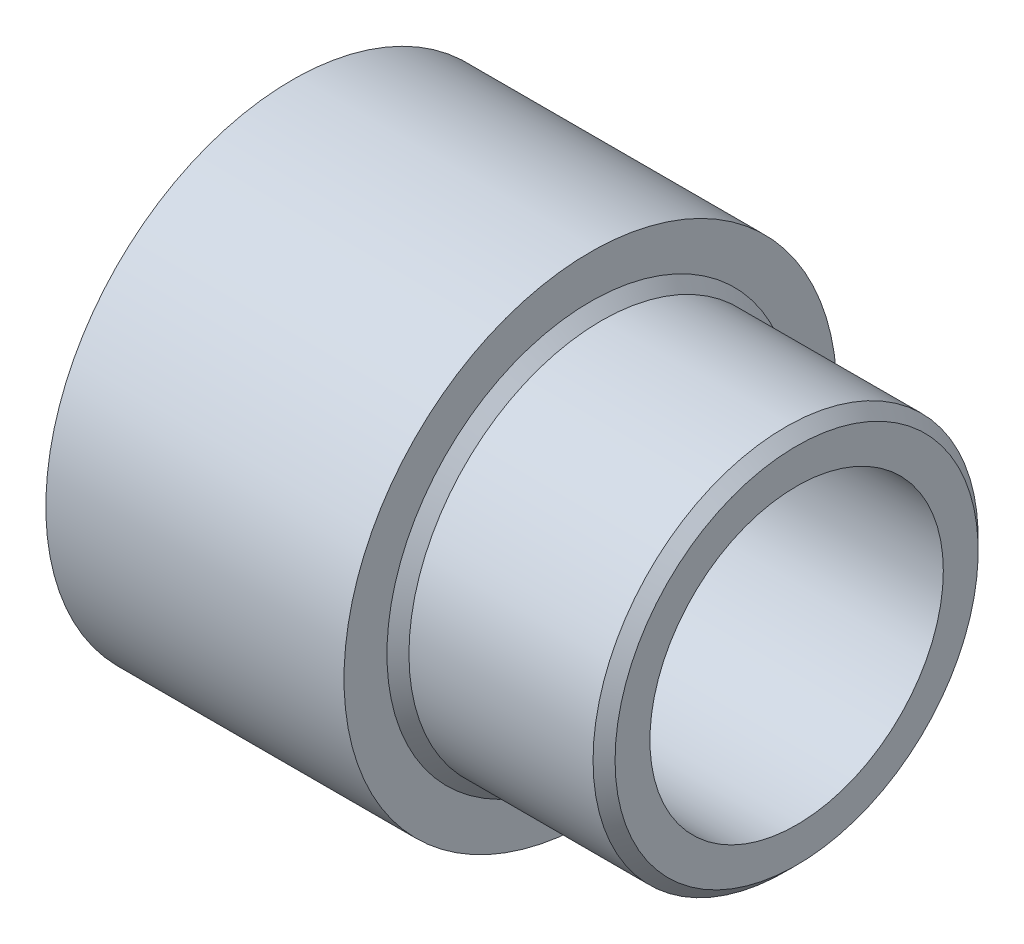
ISO-10303-21;
HEADER;
FILE_DESCRIPTION(('STEP AP214'),'2;1');
FILE_NAME('part.step','',(''),(''),'','','');
FILE_SCHEMA(('AUTOMOTIVE_DESIGN { 1 0 10303 214 1 1 1 1 }'));
ENDSEC;
DATA;
#1=APPLICATION_CONTEXT('core data for automotive mechanical design processes');
#2=APPLICATION_PROTOCOL_DEFINITION('international standard','automotive_design',2000,#1);
#3=PRODUCT_CONTEXT('',#1,'mechanical');
#4=PRODUCT('Part','Part','',(#3));
#5=PRODUCT_RELATED_PRODUCT_CATEGORY('part','',(#4));
#6=PRODUCT_DEFINITION_FORMATION('','',#4);
#7=PRODUCT_DEFINITION_CONTEXT('part definition',#1,'design');
#8=PRODUCT_DEFINITION('design','',#6,#7);
#9=PRODUCT_DEFINITION_SHAPE('','',#8);
#10=(LENGTH_UNIT() NAMED_UNIT(*) SI_UNIT(.MILLI.,.METRE.));
#11=(NAMED_UNIT(*) PLANE_ANGLE_UNIT() SI_UNIT($,.RADIAN.));
#12=(NAMED_UNIT(*) SI_UNIT($,.STERADIAN.) SOLID_ANGLE_UNIT());
#13=UNCERTAINTY_MEASURE_WITH_UNIT(LENGTH_MEASURE(1.E-05),#10,'distance_accuracy_value','');
#14=(GEOMETRIC_REPRESENTATION_CONTEXT(3) GLOBAL_UNCERTAINTY_ASSIGNED_CONTEXT((#13)) GLOBAL_UNIT_ASSIGNED_CONTEXT((#10,
#11,#12)) REPRESENTATION_CONTEXT('',''));
#15=CARTESIAN_POINT('',(0.,0.,0.));
#16=DIRECTION('',(0.,0.,1.));
#17=DIRECTION('',(1.,0.,0.));
#18=AXIS2_PLACEMENT_3D('',#15,#16,#17);
#19=CARTESIAN_POINT('',(34.925,0.,0.));
#20=DIRECTION('',(-1.,0.,0.));
#21=DIRECTION('',(0.,0.,1.));
#22=AXIS2_PLACEMENT_3D('',#19,#20,#21);
#23=PLANE('',#22);
#24=CARTESIAN_POINT('',(34.925,0.,0.));
#25=DIRECTION('',(-1.,0.,0.));
#26=DIRECTION('',(0.,0.,1.));
#27=AXIS2_PLACEMENT_3D('',#24,#25,#26);
#28=CIRCLE('',#27,12.573);
#29=CARTESIAN_POINT('',(34.925,0.,12.573));
#30=VERTEX_POINT('',#29);
#31=EDGE_CURVE('E10',#30,#30,#28,.F.);
#32=ORIENTED_EDGE('',*,*,#31,.T.);
#33=EDGE_LOOP('',(#32));
#34=FACE_BOUND('',#33,.T.);
#35=CARTESIAN_POINT('',(34.925,0.,0.));
#36=DIRECTION('',(1.,0.,0.));
#37=DIRECTION('',(0.,0.,-1.));
#38=AXIS2_PLACEMENT_3D('',#35,#36,#37);
#39=CIRCLE('',#38,10.16);
#40=CARTESIAN_POINT('',(34.925,0.,-10.16));
#41=VERTEX_POINT('',#40);
#42=EDGE_CURVE('E66',#41,#41,#39,.T.);
#43=ORIENTED_EDGE('',*,*,#42,.F.);
#44=EDGE_LOOP('',(#43));
#45=FACE_BOUND('',#44,.T.);
#46=ADVANCED_FACE('F34',(#34,#45),#23,.F.);
#47=CARTESIAN_POINT('',(19.05,0.,0.));
#48=DIRECTION('',(-1.,0.,0.));
#49=DIRECTION('',(0.,0.,1.));
#50=AXIS2_PLACEMENT_3D('',#47,#48,#49);
#51=PLANE('',#50);
#52=CARTESIAN_POINT('',(19.05,0.,0.));
#53=DIRECTION('',(-1.,0.,0.));
#54=DIRECTION('',(0.,0.,1.));
#55=AXIS2_PLACEMENT_3D('',#52,#53,#54);
#56=CIRCLE('',#55,13.5128);
#57=CARTESIAN_POINT('',(19.05,0.,13.5128));
#58=VERTEX_POINT('',#57);
#59=EDGE_CURVE('E60',#58,#58,#56,.T.);
#60=ORIENTED_EDGE('',*,*,#59,.T.);
#61=EDGE_LOOP('',(#60));
#62=FACE_BOUND('',#61,.T.);
#63=CARTESIAN_POINT('',(19.05,0.,0.));
#64=DIRECTION('',(1.,0.,0.));
#65=DIRECTION('',(0.,0.,-1.));
#66=AXIS2_PLACEMENT_3D('',#63,#64,#65);
#67=CIRCLE('',#66,10.16);
#68=CARTESIAN_POINT('',(19.05,0.,-10.16));
#69=VERTEX_POINT('',#68);
#70=EDGE_CURVE('E69',#69,#69,#67,.T.);
#71=ORIENTED_EDGE('',*,*,#70,.T.);
#72=EDGE_LOOP('',(#71));
#73=FACE_BOUND('',#72,.T.);
#74=ADVANCED_FACE('F73',(#62,#73),#51,.T.);
#75=CARTESIAN_POINT('',(20.6502,0.,0.));
#76=DIRECTION('',(-1.,0.,0.));
#77=DIRECTION('',(0.,0.,1.));
#78=AXIS2_PLACEMENT_3D('',#75,#76,#77);
#79=CYLINDRICAL_SURFACE('',#78,17.0688);
#80=CARTESIAN_POINT('',(20.6502,0.,0.));
#81=DIRECTION('',(1.,0.,0.));
#82=DIRECTION('',(0.,0.,-1.));
#83=AXIS2_PLACEMENT_3D('',#80,#81,#82);
#84=CIRCLE('',#83,17.0688);
#85=CARTESIAN_POINT('',(20.6502,0.,-17.0688));
#86=VERTEX_POINT('',#85);
#87=EDGE_CURVE('E54',#86,#86,#84,.T.);
#88=ORIENTED_EDGE('',*,*,#87,.F.);
#89=EDGE_LOOP('',(#88));
#90=FACE_BOUND('',#89,.T.);
#91=CARTESIAN_POINT('',(0.,0.,0.));
#92=DIRECTION('',(1.,0.,0.));
#93=DIRECTION('',(0.,0.,-1.));
#94=AXIS2_PLACEMENT_3D('',#91,#92,#93);
#95=CIRCLE('',#94,17.0688);
#96=CARTESIAN_POINT('',(0.,0.,-17.0688));
#97=VERTEX_POINT('',#96);
#98=EDGE_CURVE('E57',#97,#97,#95,.T.);
#99=ORIENTED_EDGE('',*,*,#98,.T.);
#100=EDGE_LOOP('',(#99));
#101=FACE_BOUND('',#100,.T.);
#102=ADVANCED_FACE('F36',(#90,#101),#79,.T.);
#103=CARTESIAN_POINT('',(20.6502,0.,0.));
#104=DIRECTION('',(1.,0.,0.));
#105=DIRECTION('',(0.,0.,-1.));
#106=AXIS2_PLACEMENT_3D('',#103,#104,#105);
#107=PLANE('',#106);
#108=CARTESIAN_POINT('',(20.6502,0.,0.));
#109=DIRECTION('',(1.,0.,0.));
#110=DIRECTION('',(0.,0.,-1.));
#111=AXIS2_PLACEMENT_3D('',#108,#109,#110);
#112=CIRCLE('',#111,14.097);
#113=CARTESIAN_POINT('',(20.6502,0.,-14.097));
#114=VERTEX_POINT('',#113);
#115=EDGE_CURVE('E41',#114,#114,#112,.F.);
#116=ORIENTED_EDGE('',*,*,#115,.T.);
#117=EDGE_LOOP('',(#116));
#118=FACE_BOUND('',#117,.T.);
#119=ORIENTED_EDGE('',*,*,#87,.T.);
#120=EDGE_LOOP('',(#119));
#121=FACE_BOUND('',#120,.T.);
#122=ADVANCED_FACE('F104',(#118,#121),#107,.T.);
#123=CARTESIAN_POINT('',(0.,0.,0.));
#124=DIRECTION('',(1.,0.,0.));
#125=DIRECTION('',(0.,0.,-1.));
#126=AXIS2_PLACEMENT_3D('',#123,#124,#125);
#127=PLANE('',#126);
#128=CARTESIAN_POINT('',(0.,0.,0.));
#129=DIRECTION('',(-1.,0.,0.));
#130=DIRECTION('',(0.,0.,1.));
#131=AXIS2_PLACEMENT_3D('',#128,#129,#130);
#132=CIRCLE('',#131,13.5128);
#133=CARTESIAN_POINT('',(0.,0.,13.5128));
#134=VERTEX_POINT('',#133);
#135=EDGE_CURVE('E63',#134,#134,#132,.T.);
#136=ORIENTED_EDGE('',*,*,#135,.F.);
#137=EDGE_LOOP('',(#136));
#138=FACE_BOUND('',#137,.T.);
#139=ORIENTED_EDGE('',*,*,#98,.F.);
#140=EDGE_LOOP('',(#139));
#141=FACE_BOUND('',#140,.T.);
#142=ADVANCED_FACE('F101',(#138,#141),#127,.F.);
#143=CARTESIAN_POINT('',(34.925,0.,0.));
#144=DIRECTION('',(-1.,0.,0.));
#145=DIRECTION('',(0.,0.,1.));
#146=AXIS2_PLACEMENT_3D('',#143,#144,#145);
#147=CYLINDRICAL_SURFACE('',#146,13.335);
#148=CARTESIAN_POINT('',(21.4122,0.,0.));
#149=DIRECTION('',(1.,0.,0.));
#150=DIRECTION('',(0.,0.,-1.));
#151=AXIS2_PLACEMENT_3D('',#148,#149,#150);
#152=CIRCLE('',#151,13.335);
#153=CARTESIAN_POINT('',(21.4122,0.,-13.335));
#154=VERTEX_POINT('',#153);
#155=EDGE_CURVE('E45',#154,#154,#152,.T.);
#156=ORIENTED_EDGE('',*,*,#155,.T.);
#157=EDGE_LOOP('',(#156));
#158=FACE_BOUND('',#157,.T.);
#159=CARTESIAN_POINT('',(34.163,0.,0.));
#160=DIRECTION('',(-1.,0.,0.));
#161=DIRECTION('',(0.,0.,1.));
#162=AXIS2_PLACEMENT_3D('',#159,#160,#161);
#163=CIRCLE('',#162,13.335);
#164=CARTESIAN_POINT('',(34.163,0.,13.335));
#165=VERTEX_POINT('',#164);
#166=EDGE_CURVE('E49',#165,#165,#163,.T.);
#167=ORIENTED_EDGE('',*,*,#166,.T.);
#168=EDGE_LOOP('',(#167));
#169=FACE_BOUND('',#168,.T.);
#170=ADVANCED_FACE('F98',(#158,#169),#147,.T.);
#171=CARTESIAN_POINT('',(21.4122,0.,0.));
#172=DIRECTION('',(-1.,0.,0.));
#173=DIRECTION('',(0.,0.,1.));
#174=AXIS2_PLACEMENT_3D('',#171,#172,#173);
#175=CONICAL_SURFACE('',#174,13.335,0.785398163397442);
#176=ORIENTED_EDGE('',*,*,#115,.F.);
#177=EDGE_LOOP('',(#176));
#178=FACE_BOUND('',#177,.T.);
#179=ORIENTED_EDGE('',*,*,#155,.F.);
#180=EDGE_LOOP('',(#179));
#181=FACE_BOUND('',#180,.T.);
#182=ADVANCED_FACE('F96',(#178,#181),#175,.T.);
#183=CARTESIAN_POINT('',(34.163,0.,0.));
#184=DIRECTION('',(-1.,0.,0.));
#185=DIRECTION('',(0.,0.,1.));
#186=AXIS2_PLACEMENT_3D('',#183,#184,#185);
#187=CONICAL_SURFACE('',#186,13.335,0.785398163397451);
#188=ORIENTED_EDGE('',*,*,#31,.F.);
#189=EDGE_LOOP('',(#188));
#190=FACE_BOUND('',#189,.T.);
#191=ORIENTED_EDGE('',*,*,#166,.F.);
#192=EDGE_LOOP('',(#191));
#193=FACE_BOUND('',#192,.T.);
#194=ADVANCED_FACE('F83',(#190,#193),#187,.T.);
#195=CARTESIAN_POINT('',(19.05,0.,0.));
#196=DIRECTION('',(-1.,0.,0.));
#197=DIRECTION('',(0.,0.,1.));
#198=AXIS2_PLACEMENT_3D('',#195,#196,#197);
#199=CYLINDRICAL_SURFACE('',#198,13.5128);
#200=CARTESIAN_POINT('',(19.05,0.,13.5128));
#201=CARTESIAN_POINT('',(18.8515625,0.,13.5128));
#202=CARTESIAN_POINT('',(18.653125,0.,13.5128));
#203=CARTESIAN_POINT('',(18.25625,0.,13.5128));
#204=CARTESIAN_POINT('',(18.0578125,0.,13.5128));
#205=CARTESIAN_POINT('',(17.6609375,0.,13.5128));
#206=CARTESIAN_POINT('',(17.4625,0.,13.5128));
#207=CARTESIAN_POINT('',(17.065625,0.,13.5128));
#208=CARTESIAN_POINT('',(16.8671875,0.,13.5128));
#209=CARTESIAN_POINT('',(16.4703125,0.,13.5128));
#210=CARTESIAN_POINT('',(16.271875,0.,13.5128));
#211=CARTESIAN_POINT('',(15.875,0.,13.5128));
#212=CARTESIAN_POINT('',(15.6765625,0.,13.5128));
#213=CARTESIAN_POINT('',(15.2796875,0.,13.5128));
#214=CARTESIAN_POINT('',(15.08125,0.,13.5128));
#215=CARTESIAN_POINT('',(14.684375,0.,13.5128));
#216=CARTESIAN_POINT('',(14.4859375,0.,13.5128));
#217=CARTESIAN_POINT('',(14.0890625,0.,13.5128));
#218=CARTESIAN_POINT('',(13.890625,0.,13.5128));
#219=CARTESIAN_POINT('',(13.49375,0.,13.5128));
#220=CARTESIAN_POINT('',(13.2953125,0.,13.5128));
#221=CARTESIAN_POINT('',(12.8984375,0.,13.5128));
#222=CARTESIAN_POINT('',(12.7,0.,13.5128));
#223=CARTESIAN_POINT('',(12.303125,0.,13.5128));
#224=CARTESIAN_POINT('',(12.1046875,0.,13.5128));
#225=CARTESIAN_POINT('',(11.7078125,0.,13.5128));
#226=CARTESIAN_POINT('',(11.509375,0.,13.5128));
#227=CARTESIAN_POINT('',(11.1125,0.,13.5128));
#228=CARTESIAN_POINT('',(10.9140625,0.,13.5128));
#229=CARTESIAN_POINT('',(10.5171875,0.,13.5128));
#230=CARTESIAN_POINT('',(10.31875,0.,13.5128));
#231=CARTESIAN_POINT('',(9.921875,0.,13.5128));
#232=CARTESIAN_POINT('',(9.7234375,0.,13.5128));
#233=CARTESIAN_POINT('',(9.3265625,0.,13.5128));
#234=CARTESIAN_POINT('',(9.128125,0.,13.5128));
#235=CARTESIAN_POINT('',(8.73125,0.,13.5128));
#236=CARTESIAN_POINT('',(8.5328125,0.,13.5128));
#237=CARTESIAN_POINT('',(8.1359375,0.,13.5128));
#238=CARTESIAN_POINT('',(7.9375,0.,13.5128));
#239=CARTESIAN_POINT('',(7.540625,0.,13.5128));
#240=CARTESIAN_POINT('',(7.3421875,0.,13.5128));
#241=CARTESIAN_POINT('',(6.9453125,0.,13.5128));
#242=CARTESIAN_POINT('',(6.746875,0.,13.5128));
#243=CARTESIAN_POINT('',(6.35,0.,13.5128));
#244=CARTESIAN_POINT('',(6.1515625,0.,13.5128));
#245=CARTESIAN_POINT('',(5.7546875,0.,13.5128));
#246=CARTESIAN_POINT('',(5.55625,0.,13.5128));
#247=CARTESIAN_POINT('',(5.159375,0.,13.5128));
#248=CARTESIAN_POINT('',(4.9609375,0.,13.5128));
#249=CARTESIAN_POINT('',(4.5640625,0.,13.5128));
#250=CARTESIAN_POINT('',(4.365625,0.,13.5128));
#251=CARTESIAN_POINT('',(3.96875,0.,13.5128));
#252=CARTESIAN_POINT('',(3.7703125,0.,13.5128));
#253=CARTESIAN_POINT('',(3.3734375,0.,13.5128));
#254=CARTESIAN_POINT('',(3.175,0.,13.5128));
#255=CARTESIAN_POINT('',(2.778125,0.,13.5128));
#256=CARTESIAN_POINT('',(2.5796875,0.,13.5128));
#257=CARTESIAN_POINT('',(2.1828125,0.,13.5128));
#258=CARTESIAN_POINT('',(1.984375,0.,13.5128));
#259=CARTESIAN_POINT('',(1.5875,0.,13.5128));
#260=CARTESIAN_POINT('',(1.3890625,0.,13.5128));
#261=CARTESIAN_POINT('',(0.992187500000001,0.,13.5128));
#262=CARTESIAN_POINT('',(0.793750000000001,0.,13.5128));
#263=CARTESIAN_POINT('',(0.396875,0.,13.5128));
#264=CARTESIAN_POINT('',(0.1984375,0.,13.5128));
#265=CARTESIAN_POINT('',(0.,0.,13.5128));
#266=B_SPLINE_CURVE_WITH_KNOTS('',3,(#200,#201,#202,#203,#204,#205,#206,#207,#208,#209,#210,
#211,#212,#213,#214,#215,#216,#217,#218,#219,#220,#221,#222,#223,#224,#225,#226,#227,#228,#229,
#230,#231,#232,#233,#234,#235,#236,#237,#238,#239,#240,#241,#242,#243,#244,#245,#246,#247,#248,
#249,#250,#251,#252,#253,#254,#255,#256,#257,#258,#259,#260,#261,#262,#263,#264,#265),
.UNSPECIFIED.,.F.,.F.,(4,2,2,2,2,2,2,2,2,2,2,2,2,2,2,2,2,2,2,2,2,2,2,2,2,2,2,2,2,2,2,2,4),(0.,
0.5953125,1.190625,1.7859375,2.38125,2.9765625,3.571875,4.1671875,4.7625,5.3578125,5.953125,
6.5484375,7.14375,7.7390625,8.334375,8.9296875,9.525,10.1203125,10.715625,11.3109375,11.90625,
12.5015625,13.096875,13.6921875,14.2875,14.8828125,15.478125,16.0734375,16.66875,17.2640625,
17.859375,18.4546875,19.05),.UNSPECIFIED.);
#267=EDGE_CURVE('BSEAM77',#58,#134,#266,.T.);
#268=ORIENTED_EDGE('',*,*,#59,.F.);
#269=ORIENTED_EDGE('',*,*,#135,.T.);
#270=ORIENTED_EDGE('',*,*,#267,.T.);
#271=ORIENTED_EDGE('',*,*,#267,.F.);
#272=EDGE_LOOP('',(#268,#270,#269,#271));
#273=FACE_BOUND('',#272,.T.);
#274=ADVANCED_FACE('F77',(#273),#199,.F.);
#275=CARTESIAN_POINT('',(34.925,0.,0.));
#276=DIRECTION('',(-1.,0.,0.));
#277=DIRECTION('',(0.,0.,1.));
#278=AXIS2_PLACEMENT_3D('',#275,#276,#277);
#279=CYLINDRICAL_SURFACE('',#278,10.16);
#280=ORIENTED_EDGE('',*,*,#42,.T.);
#281=EDGE_LOOP('',(#280));
#282=FACE_BOUND('',#281,.T.);
#283=ORIENTED_EDGE('',*,*,#70,.F.);
#284=EDGE_LOOP('',(#283));
#285=FACE_BOUND('',#284,.T.);
#286=ADVANCED_FACE('F75',(#282,#285),#279,.F.);
#287=CLOSED_SHELL('',(#46,#74,#102,#122,#142,#170,#182,#194,#274,#286));
#288=MANIFOLD_SOLID_BREP('B2',#287);
#289=ADVANCED_BREP_SHAPE_REPRESENTATION('',(#18,#288),#14);
#290=SHAPE_DEFINITION_REPRESENTATION(#9,#289);
ENDSEC;
END-ISO-10303-21;
